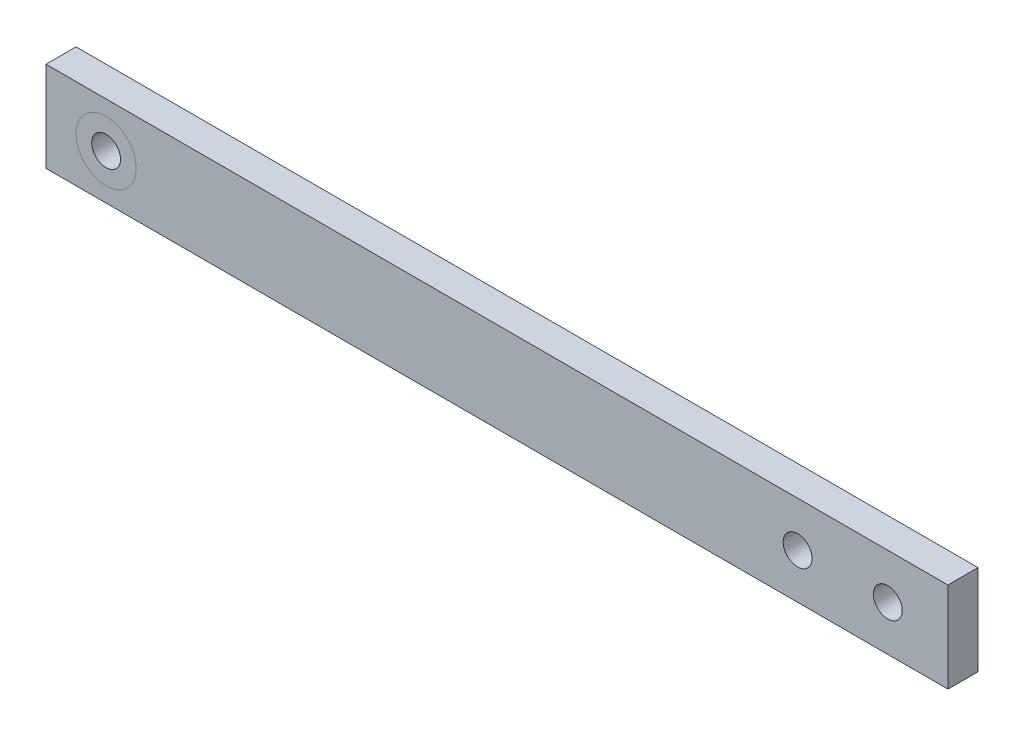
from build123d import *

# Parameters (mm, degrees)
SKETCH1_W          = 381
SKETCH1_H          = 38.1
EXTRUDE1_DEPTH     = 12.7
SKETCH2_R          = 6.1
CUT_EXTRUDE1_DEPTH = 384.110819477
SKETCH3_R          = 6.1
CUT_EXTRUDE2_DEPTH = 412.022135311
SKETCH4_R          = 6.1
CUT_EXTRUDE3_DEPTH = 384.110819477


with BuildPart() as part:
    # Sketch1 → Extrude1 (new body)
    with BuildSketch(Plane.XY):
        with Locations((190.5, 19.05)):
            Rectangle(SKETCH1_W, SKETCH1_H)
    extrude(amount=EXTRUDE1_DEPTH)

    # Sketch2 → Cut-Extrude1 (cut, through all)
    with BuildSketch(Plane.XY.offset(12.7)):
        with Locations((355.6, 19.05)):
            Circle(SKETCH2_R)
    extrude(amount=-CUT_EXTRUDE1_DEPTH, mode=Mode.SUBTRACT)

    # Sketch3 → Cut-Extrude2 (cut, through all)
    with BuildSketch(Plane(origin=(-27.787295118, -2.77606959, 12.7), x_dir=(1, 0, 0), z_dir=(0, 0, 1))):
        with Locations((345.287295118, 21.82606959)):
            Circle(SKETCH3_R)
    extrude(amount=-CUT_EXTRUDE2_DEPTH, mode=Mode.SUBTRACT)

    # Sketch4 → Cut-Extrude3 (cut, through all)
    with BuildSketch(Plane.XY.offset(12.7)):
        with Locations((25.4, 19.05)):
            Circle(SKETCH4_R)
    extrude(amount=-CUT_EXTRUDE3_DEPTH, mode=Mode.SUBTRACT)


solid = part.part
